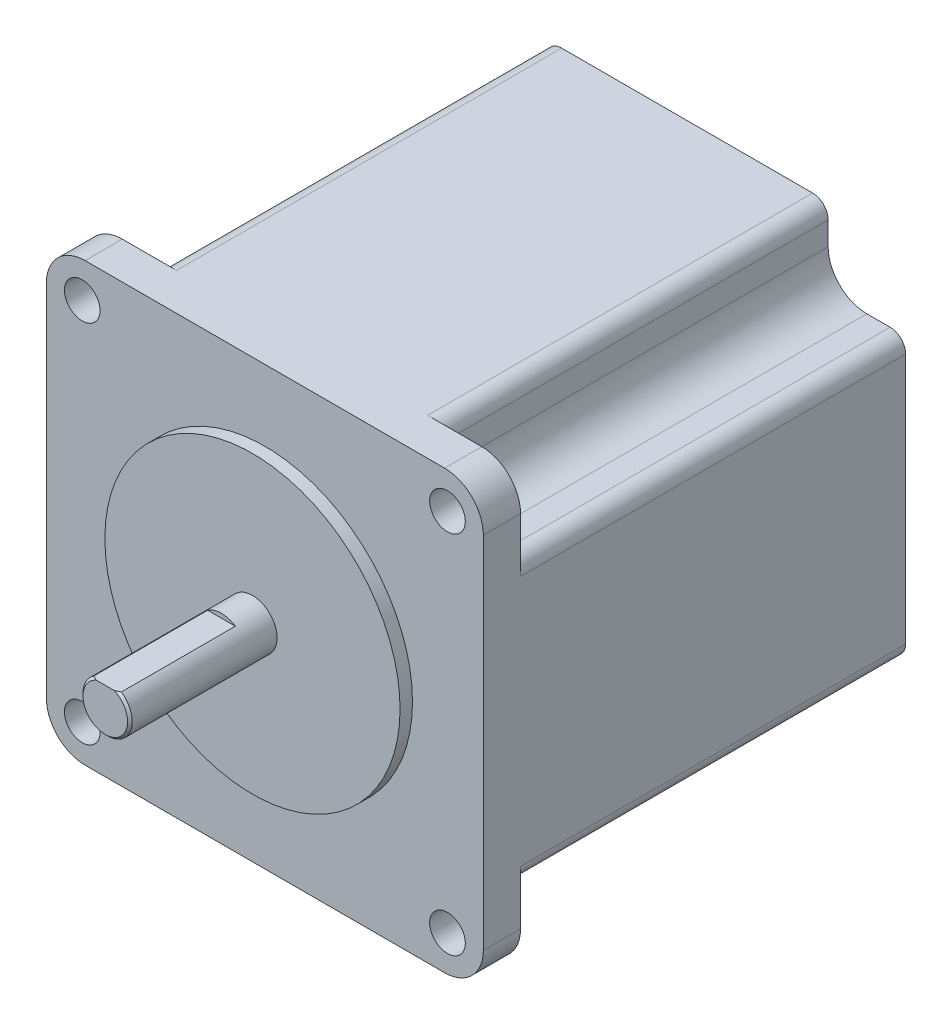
ISO-10303-21;
HEADER;
FILE_DESCRIPTION(('STEP AP214'),'2;1');
FILE_NAME('part.step','',(''),(''),'','','');
FILE_SCHEMA(('AUTOMOTIVE_DESIGN { 1 0 10303 214 1 1 1 1 }'));
ENDSEC;
DATA;
#1=APPLICATION_CONTEXT('core data for automotive mechanical design processes');
#2=APPLICATION_PROTOCOL_DEFINITION('international standard','automotive_design',2000,#1);
#3=PRODUCT_CONTEXT('',#1,'mechanical');
#4=PRODUCT('Part','Part','',(#3));
#5=PRODUCT_RELATED_PRODUCT_CATEGORY('part','',(#4));
#6=PRODUCT_DEFINITION_FORMATION('','',#4);
#7=PRODUCT_DEFINITION_CONTEXT('part definition',#1,'design');
#8=PRODUCT_DEFINITION('design','',#6,#7);
#9=PRODUCT_DEFINITION_SHAPE('','',#8);
#10=(LENGTH_UNIT() NAMED_UNIT(*) SI_UNIT(.MILLI.,.METRE.));
#11=(NAMED_UNIT(*) PLANE_ANGLE_UNIT() SI_UNIT($,.RADIAN.));
#12=(NAMED_UNIT(*) SI_UNIT($,.STERADIAN.) SOLID_ANGLE_UNIT());
#13=UNCERTAINTY_MEASURE_WITH_UNIT(LENGTH_MEASURE(1.E-05),#10,'distance_accuracy_value','');
#14=(GEOMETRIC_REPRESENTATION_CONTEXT(3) GLOBAL_UNCERTAINTY_ASSIGNED_CONTEXT((#13)) GLOBAL_UNIT_ASSIGNED_CONTEXT((#10,
#11,#12)) REPRESENTATION_CONTEXT('',''));
#15=CARTESIAN_POINT('',(0.,0.,0.));
#16=DIRECTION('',(0.,0.,1.));
#17=DIRECTION('',(1.,0.,0.));
#18=AXIS2_PLACEMENT_3D('',#15,#16,#17);
#19=CARTESIAN_POINT('',(23.2,-23.2,-56.1));
#20=DIRECTION('',(0.,0.,1.));
#21=DIRECTION('',(1.,0.,0.));
#22=AXIS2_PLACEMENT_3D('',#19,#20,#21);
#23=CYLINDRICAL_SURFACE('',#22,5.);
#24=CARTESIAN_POINT('',(23.2,-23.2,-6.4));
#25=DIRECTION('',(0.,0.,-1.));
#26=DIRECTION('',(-1.,0.,0.));
#27=AXIS2_PLACEMENT_3D('',#24,#25,#26);
#28=CIRCLE('',#27,5.);
#29=CARTESIAN_POINT('',(28.2,-23.2,-6.4));
#30=VERTEX_POINT('',#29);
#31=CARTESIAN_POINT('',(23.2,-28.2,-6.4));
#32=VERTEX_POINT('',#31);
#33=EDGE_CURVE('E309',#30,#32,#28,.T.);
#34=ORIENTED_EDGE('',*,*,#33,.F.);
#35=DIRECTION('',(0.,0.,1.));
#36=VECTOR('',#35,1.);
#37=CARTESIAN_POINT('',(28.2,-23.2,-56.1));
#38=LINE('',#37,#36);
#39=CARTESIAN_POINT('',(28.2,-23.2,-1.6));
#40=VERTEX_POINT('',#39);
#41=EDGE_CURVE('E474',#30,#40,#38,.T.);
#42=ORIENTED_EDGE('',*,*,#41,.T.);
#43=CARTESIAN_POINT('',(23.2,-23.2,-1.6));
#44=DIRECTION('',(0.,0.,-1.));
#45=DIRECTION('',(1.,0.,0.));
#46=AXIS2_PLACEMENT_3D('',#43,#44,#45);
#47=CIRCLE('',#46,5.);
#48=CARTESIAN_POINT('',(23.2,-28.2,-1.6));
#49=VERTEX_POINT('',#48);
#50=EDGE_CURVE('E464',#40,#49,#47,.T.);
#51=ORIENTED_EDGE('',*,*,#50,.T.);
#52=DIRECTION('',(0.,0.,1.));
#53=VECTOR('',#52,1.);
#54=CARTESIAN_POINT('',(23.2,-28.2,-56.1));
#55=LINE('',#54,#53);
#56=EDGE_CURVE('E510',#32,#49,#55,.T.);
#57=ORIENTED_EDGE('',*,*,#56,.F.);
#58=EDGE_LOOP('',(#34,#42,#51,#57));
#59=FACE_BOUND('',#58,.T.);
#60=ADVANCED_FACE('F35',(#59),#23,.T.);
#61=CARTESIAN_POINT('',(-23.2,-23.2,-56.1));
#62=DIRECTION('',(0.,0.,1.));
#63=DIRECTION('',(1.,0.,0.));
#64=AXIS2_PLACEMENT_3D('',#61,#62,#63);
#65=CYLINDRICAL_SURFACE('',#64,5.);
#66=CARTESIAN_POINT('',(-23.2,-23.2,-6.4));
#67=DIRECTION('',(0.,0.,-1.));
#68=DIRECTION('',(-1.,0.,0.));
#69=AXIS2_PLACEMENT_3D('',#66,#67,#68);
#70=CIRCLE('',#69,5.);
#71=CARTESIAN_POINT('',(-23.2,-28.2,-6.4));
#72=VERTEX_POINT('',#71);
#73=CARTESIAN_POINT('',(-28.2,-23.2,-6.4));
#74=VERTEX_POINT('',#73);
#75=EDGE_CURVE('E354',#72,#74,#70,.T.);
#76=ORIENTED_EDGE('',*,*,#75,.F.);
#77=DIRECTION('',(0.,0.,1.));
#78=VECTOR('',#77,1.);
#79=CARTESIAN_POINT('',(-23.2,-28.2,-56.1));
#80=LINE('',#79,#78);
#81=CARTESIAN_POINT('',(-23.2,-28.2,-1.6));
#82=VERTEX_POINT('',#81);
#83=EDGE_CURVE('E508',#72,#82,#80,.T.);
#84=ORIENTED_EDGE('',*,*,#83,.T.);
#85=CARTESIAN_POINT('',(-23.2,-23.2,-1.6));
#86=DIRECTION('',(0.,0.,-1.));
#87=DIRECTION('',(1.,0.,0.));
#88=AXIS2_PLACEMENT_3D('',#85,#86,#87);
#89=CIRCLE('',#88,5.);
#90=CARTESIAN_POINT('',(-28.2,-23.2,-1.6));
#91=VERTEX_POINT('',#90);
#92=EDGE_CURVE('E480',#82,#91,#89,.T.);
#93=ORIENTED_EDGE('',*,*,#92,.T.);
#94=DIRECTION('',(0.,0.,1.));
#95=VECTOR('',#94,1.);
#96=CARTESIAN_POINT('',(-28.2,-23.2,-56.1));
#97=LINE('',#96,#95);
#98=EDGE_CURVE('E506',#74,#91,#97,.T.);
#99=ORIENTED_EDGE('',*,*,#98,.F.);
#100=EDGE_LOOP('',(#76,#84,#93,#99));
#101=FACE_BOUND('',#100,.T.);
#102=ADVANCED_FACE('F595',(#101),#65,.T.);
#103=CARTESIAN_POINT('',(23.2,23.2,-56.1));
#104=DIRECTION('',(0.,0.,1.));
#105=DIRECTION('',(1.,0.,0.));
#106=AXIS2_PLACEMENT_3D('',#103,#104,#105);
#107=CYLINDRICAL_SURFACE('',#106,5.);
#108=CARTESIAN_POINT('',(23.2,23.2,-6.4));
#109=DIRECTION('',(0.,0.,-1.));
#110=DIRECTION('',(-1.,0.,0.));
#111=AXIS2_PLACEMENT_3D('',#108,#109,#110);
#112=CIRCLE('',#111,5.);
#113=CARTESIAN_POINT('',(23.2,28.2,-6.4));
#114=VERTEX_POINT('',#113);
#115=CARTESIAN_POINT('',(28.2,23.2,-6.4));
#116=VERTEX_POINT('',#115);
#117=EDGE_CURVE('E401',#114,#116,#112,.T.);
#118=ORIENTED_EDGE('',*,*,#117,.F.);
#119=DIRECTION('',(0.,0.,1.));
#120=VECTOR('',#119,1.);
#121=CARTESIAN_POINT('',(23.2,28.2,-56.1));
#122=LINE('',#121,#120);
#123=CARTESIAN_POINT('',(23.2,28.2,-1.6));
#124=VERTEX_POINT('',#123);
#125=EDGE_CURVE('E500',#114,#124,#122,.T.);
#126=ORIENTED_EDGE('',*,*,#125,.T.);
#127=CARTESIAN_POINT('',(23.2,23.2,-1.6));
#128=DIRECTION('',(0.,0.,-1.));
#129=DIRECTION('',(1.,0.,0.));
#130=AXIS2_PLACEMENT_3D('',#127,#128,#129);
#131=CIRCLE('',#130,5.);
#132=CARTESIAN_POINT('',(28.2,23.2,-1.6));
#133=VERTEX_POINT('',#132);
#134=EDGE_CURVE('E492',#124,#133,#131,.T.);
#135=ORIENTED_EDGE('',*,*,#134,.T.);
#136=DIRECTION('',(0.,0.,1.));
#137=VECTOR('',#136,1.);
#138=CARTESIAN_POINT('',(28.2,23.2,-56.1));
#139=LINE('',#138,#137);
#140=EDGE_CURVE('E498',#116,#133,#139,.T.);
#141=ORIENTED_EDGE('',*,*,#140,.F.);
#142=EDGE_LOOP('',(#118,#126,#135,#141));
#143=FACE_BOUND('',#142,.T.);
#144=ADVANCED_FACE('F586',(#143),#107,.T.);
#145=CARTESIAN_POINT('',(0.,0.,0.));
#146=DIRECTION('',(0.,0.,1.));
#147=DIRECTION('',(1.,0.,0.));
#148=AXIS2_PLACEMENT_3D('',#145,#146,#147);
#149=PLANE('',#148);
#150=CARTESIAN_POINT('',(0.,0.,0.));
#151=DIRECTION('',(0.,0.,1.));
#152=DIRECTION('',(1.,0.,0.));
#153=AXIS2_PLACEMENT_3D('',#150,#151,#152);
#154=CIRCLE('',#153,19.05);
#155=CARTESIAN_POINT('',(19.05,0.,0.));
#156=VERTEX_POINT('',#155);
#157=EDGE_CURVE('E525',#156,#156,#154,.T.);
#158=ORIENTED_EDGE('',*,*,#157,.T.);
#159=EDGE_LOOP('',(#158));
#160=FACE_BOUND('',#159,.T.);
#161=CARTESIAN_POINT('',(0.,0.,0.));
#162=DIRECTION('',(0.,0.,1.));
#163=DIRECTION('',(1.,0.,0.));
#164=AXIS2_PLACEMENT_3D('',#161,#162,#163);
#165=CIRCLE('',#164,3.175);
#166=CARTESIAN_POINT('',(3.175,0.,0.));
#167=VERTEX_POINT('',#166);
#168=EDGE_CURVE('E522',#167,#167,#165,.T.);
#169=ORIENTED_EDGE('',*,*,#168,.F.);
#170=EDGE_LOOP('',(#169));
#171=FACE_BOUND('',#170,.T.);
#172=ADVANCED_FACE('F584',(#160,#171),#149,.T.);
#173=CARTESIAN_POINT('',(0.,0.,-1.6));
#174=DIRECTION('',(0.,0.,1.));
#175=DIRECTION('',(1.,0.,0.));
#176=AXIS2_PLACEMENT_3D('',#173,#174,#175);
#177=CYLINDRICAL_SURFACE('',#176,19.05);
#178=CARTESIAN_POINT('',(0.,0.,-1.6));
#179=DIRECTION('',(0.,0.,1.));
#180=DIRECTION('',(1.,0.,0.));
#181=AXIS2_PLACEMENT_3D('',#178,#179,#180);
#182=CIRCLE('',#181,19.05);
#183=CARTESIAN_POINT('',(19.05,0.,-1.6));
#184=VERTEX_POINT('',#183);
#185=EDGE_CURVE('E512',#184,#184,#182,.F.);
#186=ORIENTED_EDGE('',*,*,#185,.F.);
#187=EDGE_LOOP('',(#186));
#188=FACE_BOUND('',#187,.T.);
#189=ORIENTED_EDGE('',*,*,#157,.F.);
#190=EDGE_LOOP('',(#189));
#191=FACE_BOUND('',#190,.T.);
#192=ADVANCED_FACE('F583',(#188,#191),#177,.T.);
#193=CARTESIAN_POINT('',(0.,0.,19.));
#194=DIRECTION('',(0.,0.,-1.));
#195=DIRECTION('',(-1.,0.,0.));
#196=AXIS2_PLACEMENT_3D('',#193,#194,#195);
#197=CYLINDRICAL_SURFACE('',#196,3.175);
#198=DIRECTION('',(0.,0.,-1.));
#199=VECTOR('',#198,1.);
#200=CARTESIAN_POINT('',(1.78605710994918,2.625,19.));
#201=LINE('',#200,#199);
#202=CARTESIAN_POINT('',(1.78605710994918,2.625,4.));
#203=VERTEX_POINT('',#202);
#204=CARTESIAN_POINT('',(1.78605710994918,2.625,18.7));
#205=VERTEX_POINT('',#204);
#206=EDGE_CURVE('E518',#203,#205,#201,.F.);
#207=ORIENTED_EDGE('',*,*,#206,.T.);
#208=CARTESIAN_POINT('',(0.,0.,18.7));
#209=DIRECTION('',(0.,0.,1.));
#210=DIRECTION('',(1.,0.,0.));
#211=AXIS2_PLACEMENT_3D('',#208,#209,#210);
#212=CIRCLE('',#211,3.175);
#213=CARTESIAN_POINT('',(-1.78605710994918,2.625,18.7));
#214=VERTEX_POINT('',#213);
#215=EDGE_CURVE('E11',#205,#214,#212,.F.);
#216=ORIENTED_EDGE('',*,*,#215,.T.);
#217=DIRECTION('',(0.,0.,-1.));
#218=VECTOR('',#217,1.);
#219=CARTESIAN_POINT('',(-1.78605710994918,2.625,19.));
#220=LINE('',#219,#218);
#221=CARTESIAN_POINT('',(-1.78605710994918,2.625,4.));
#222=VERTEX_POINT('',#221);
#223=EDGE_CURVE('E520',#214,#222,#220,.T.);
#224=ORIENTED_EDGE('',*,*,#223,.T.);
#225=CARTESIAN_POINT('',(0.,0.,4.));
#226=DIRECTION('',(0.,0.,1.));
#227=DIRECTION('',(1.,0.,0.));
#228=AXIS2_PLACEMENT_3D('',#225,#226,#227);
#229=CIRCLE('',#228,3.175);
#230=EDGE_CURVE('E530',#203,#222,#229,.T.);
#231=ORIENTED_EDGE('',*,*,#230,.F.);
#232=EDGE_LOOP('',(#207,#216,#224,#231));
#233=FACE_BOUND('',#232,.T.);
#234=ORIENTED_EDGE('',*,*,#168,.T.);
#235=EDGE_LOOP('',(#234));
#236=FACE_BOUND('',#235,.T.);
#237=ADVANCED_FACE('F579',(#233,#236),#197,.T.);
#238=CARTESIAN_POINT('',(0.,0.,19.));
#239=DIRECTION('',(0.,0.,1.));
#240=DIRECTION('',(1.,0.,0.));
#241=AXIS2_PLACEMENT_3D('',#238,#239,#240);
#242=PLANE('',#241);
#243=DIRECTION('',(1.,0.,0.));
#244=VECTOR('',#243,1.);
#245=CARTESIAN_POINT('',(0.,2.625,19.));
#246=LINE('',#245,#244);
#247=CARTESIAN_POINT('',(-1.17260393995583,2.625,19.));
#248=VERTEX_POINT('',#247);
#249=CARTESIAN_POINT('',(1.17260393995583,2.625,19.));
#250=VERTEX_POINT('',#249);
#251=EDGE_CURVE('E528',#248,#250,#246,.T.);
#252=ORIENTED_EDGE('',*,*,#251,.F.);
#253=CARTESIAN_POINT('',(0.,0.,19.));
#254=DIRECTION('',(0.,0.,1.));
#255=DIRECTION('',(1.,0.,0.));
#256=AXIS2_PLACEMENT_3D('',#253,#254,#255);
#257=CIRCLE('',#256,2.87499999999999);
#258=EDGE_CURVE('E542',#248,#250,#257,.T.);
#259=ORIENTED_EDGE('',*,*,#258,.T.);
#260=EDGE_LOOP('',(#252,#259));
#261=FACE_BOUND('',#260,.T.);
#262=ADVANCED_FACE('F575',(#261),#242,.T.);
#263=CARTESIAN_POINT('',(0.,0.,4.));
#264=DIRECTION('',(0.,0.,1.));
#265=DIRECTION('',(1.,0.,0.));
#266=AXIS2_PLACEMENT_3D('',#263,#264,#265);
#267=PLANE('',#266);
#268=ORIENTED_EDGE('',*,*,#230,.T.);
#269=DIRECTION('',(1.,0.,0.));
#270=VECTOR('',#269,1.);
#271=CARTESIAN_POINT('',(-4.59956773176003,2.625,4.));
#272=LINE('',#271,#270);
#273=EDGE_CURVE('E515',#222,#203,#272,.T.);
#274=ORIENTED_EDGE('',*,*,#273,.T.);
#275=EDGE_LOOP('',(#268,#274));
#276=FACE_BOUND('',#275,.T.);
#277=ADVANCED_FACE('F573',(#276),#267,.T.);
#278=CARTESIAN_POINT('',(0.,2.625,4.));
#279=DIRECTION('',(0.,-1.,0.));
#280=DIRECTION('',(0.,0.,-1.));
#281=AXIS2_PLACEMENT_3D('',#278,#279,#280);
#282=PLANE('',#281);
#283=ORIENTED_EDGE('',*,*,#251,.T.);
#284=CARTESIAN_POINT('',(1.17260393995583,2.625,19.));
#285=CARTESIAN_POINT('',(1.22536416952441,2.625,18.9784772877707));
#286=CARTESIAN_POINT('',(1.27769536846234,2.625,18.9559264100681));
#287=CARTESIAN_POINT('',(1.38148707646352,2.625,18.9090288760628));
#288=CARTESIAN_POINT('',(1.43294838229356,2.625,18.8846839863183));
#289=CARTESIAN_POINT('',(1.53508217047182,2.625,18.8344201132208));
#290=CARTESIAN_POINT('',(1.58575477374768,2.625,18.8085013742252));
#291=CARTESIAN_POINT('',(1.68641811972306,2.625,18.7552545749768));
#292=CARTESIAN_POINT('',(1.73640815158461,2.625,18.7279251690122));
#293=CARTESIAN_POINT('',(1.78605710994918,2.625,18.7));
#294=B_SPLINE_CURVE_WITH_KNOTS('',3,(#284,#285,#286,#287,#288,#289,#290,#291,#292,#293),
.UNSPECIFIED.,.F.,.F.,(4,2,2,2,4),(0.,0.170920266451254,0.341674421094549,0.512402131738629,
0.683295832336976),.UNSPECIFIED.);
#295=EDGE_CURVE('E44',#250,#205,#294,.T.);
#296=ORIENTED_EDGE('',*,*,#295,.T.);
#297=ORIENTED_EDGE('',*,*,#206,.F.);
#298=ORIENTED_EDGE('',*,*,#273,.F.);
#299=ORIENTED_EDGE('',*,*,#223,.F.);
#300=CARTESIAN_POINT('',(-1.78605710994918,2.625,18.7));
#301=CARTESIAN_POINT('',(-1.73640815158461,2.625,18.7279251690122));
#302=CARTESIAN_POINT('',(-1.68641811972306,2.625,18.7552545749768));
#303=CARTESIAN_POINT('',(-1.58575477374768,2.625,18.8085013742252));
#304=CARTESIAN_POINT('',(-1.53508217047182,2.625,18.8344201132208));
#305=CARTESIAN_POINT('',(-1.43294838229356,2.625,18.8846839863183));
#306=CARTESIAN_POINT('',(-1.38148707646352,2.625,18.9090288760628));
#307=CARTESIAN_POINT('',(-1.27769536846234,2.625,18.9559264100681));
#308=CARTESIAN_POINT('',(-1.22536416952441,2.625,18.9784772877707));
#309=CARTESIAN_POINT('',(-1.17260393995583,2.625,19.));
#310=B_SPLINE_CURVE_WITH_KNOTS('',3,(#300,#301,#302,#303,#304,#305,#306,#307,#308,#309),
.UNSPECIFIED.,.F.,.F.,(4,2,2,2,4),(0.,0.170893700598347,0.341621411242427,0.512375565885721,
0.683295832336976),.UNSPECIFIED.);
#311=EDGE_CURVE('E559',#214,#248,#310,.T.);
#312=ORIENTED_EDGE('',*,*,#311,.T.);
#313=EDGE_LOOP('',(#283,#296,#297,#298,#299,#312));
#314=FACE_BOUND('',#313,.T.);
#315=ADVANCED_FACE('F567',(#314),#282,.F.);
#316=CARTESIAN_POINT('',(-23.2,-28.2,-56.1));
#317=DIRECTION('',(0.,1.,0.));
#318=DIRECTION('',(-1.,0.,0.));
#319=AXIS2_PLACEMENT_3D('',#316,#317,#318);
#320=PLANE('',#319);
#321=DIRECTION('',(0.,0.,-1.));
#322=VECTOR('',#321,1.);
#323=CARTESIAN_POINT('',(-16.2,-28.2,-6.4));
#324=LINE('',#323,#322);
#325=CARTESIAN_POINT('',(-16.2,-28.2,-6.4));
#326=VERTEX_POINT('',#325);
#327=CARTESIAN_POINT('',(-16.2,-28.2,-56.1));
#328=VERTEX_POINT('',#327);
#329=EDGE_CURVE('E338',#326,#328,#324,.T.);
#330=ORIENTED_EDGE('',*,*,#329,.T.);
#331=DIRECTION('',(-1.,0.,0.));
#332=VECTOR('',#331,1.);
#333=CARTESIAN_POINT('',(-23.2,-28.2,-56.1));
#334=LINE('',#333,#332);
#335=CARTESIAN_POINT('',(16.2,-28.2,-56.1));
#336=VERTEX_POINT('',#335);
#337=EDGE_CURVE('E465',#336,#328,#334,.T.);
#338=ORIENTED_EDGE('',*,*,#337,.F.);
#339=DIRECTION('',(0.,0.,-1.));
#340=VECTOR('',#339,1.);
#341=CARTESIAN_POINT('',(16.2,-28.2,-6.4));
#342=LINE('',#341,#340);
#343=CARTESIAN_POINT('',(16.2,-28.2,-6.4));
#344=VERTEX_POINT('',#343);
#345=EDGE_CURVE('E312',#344,#336,#342,.T.);
#346=ORIENTED_EDGE('',*,*,#345,.F.);
#347=DIRECTION('',(-1.,0.,0.));
#348=VECTOR('',#347,1.);
#349=CARTESIAN_POINT('',(-23.2,-28.2,-6.4));
#350=LINE('',#349,#348);
#351=EDGE_CURVE('E319',#32,#344,#350,.T.);
#352=ORIENTED_EDGE('',*,*,#351,.F.);
#353=ORIENTED_EDGE('',*,*,#56,.T.);
#354=DIRECTION('',(-1.,0.,0.));
#355=VECTOR('',#354,1.);
#356=CARTESIAN_POINT('',(-23.2,-28.2,-1.6));
#357=LINE('',#356,#355);
#358=EDGE_CURVE('E477',#49,#82,#357,.T.);
#359=ORIENTED_EDGE('',*,*,#358,.T.);
#360=ORIENTED_EDGE('',*,*,#83,.F.);
#361=DIRECTION('',(-1.,0.,0.));
#362=VECTOR('',#361,1.);
#363=CARTESIAN_POINT('',(-23.2,-28.2,-6.4));
#364=LINE('',#363,#362);
#365=EDGE_CURVE('E366',#326,#72,#364,.T.);
#366=ORIENTED_EDGE('',*,*,#365,.F.);
#367=EDGE_LOOP('',(#330,#338,#346,#352,#353,#359,#360,#366));
#368=FACE_BOUND('',#367,.T.);
#369=ADVANCED_FACE('F572',(#368),#320,.F.);
#370=CARTESIAN_POINT('',(-28.2,23.2,-56.1));
#371=DIRECTION('',(1.,0.,0.));
#372=DIRECTION('',(0.,1.,0.));
#373=AXIS2_PLACEMENT_3D('',#370,#371,#372);
#374=PLANE('',#373);
#375=DIRECTION('',(0.,0.,-1.));
#376=VECTOR('',#375,1.);
#377=CARTESIAN_POINT('',(-28.2,16.2,-6.4));
#378=LINE('',#377,#376);
#379=CARTESIAN_POINT('',(-28.2,16.2,-6.4));
#380=VERTEX_POINT('',#379);
#381=CARTESIAN_POINT('',(-28.2,16.2,-56.1));
#382=VERTEX_POINT('',#381);
#383=EDGE_CURVE('E446',#380,#382,#378,.T.);
#384=ORIENTED_EDGE('',*,*,#383,.T.);
#385=DIRECTION('',(0.,1.,0.));
#386=VECTOR('',#385,1.);
#387=CARTESIAN_POINT('',(-28.2,23.2,-56.1));
#388=LINE('',#387,#386);
#389=CARTESIAN_POINT('',(-28.2,-16.2,-56.1));
#390=VERTEX_POINT('',#389);
#391=EDGE_CURVE('E467',#390,#382,#388,.T.);
#392=ORIENTED_EDGE('',*,*,#391,.F.);
#393=DIRECTION('',(0.,0.,-1.));
#394=VECTOR('',#393,1.);
#395=CARTESIAN_POINT('',(-28.2,-16.2,-6.4));
#396=LINE('',#395,#394);
#397=CARTESIAN_POINT('',(-28.2,-16.2,-6.4));
#398=VERTEX_POINT('',#397);
#399=EDGE_CURVE('E361',#398,#390,#396,.T.);
#400=ORIENTED_EDGE('',*,*,#399,.F.);
#401=DIRECTION('',(0.,1.,0.));
#402=VECTOR('',#401,1.);
#403=CARTESIAN_POINT('',(-28.2,23.2,-6.4));
#404=LINE('',#403,#402);
#405=EDGE_CURVE('E538',#74,#398,#404,.T.);
#406=ORIENTED_EDGE('',*,*,#405,.F.);
#407=ORIENTED_EDGE('',*,*,#98,.T.);
#408=DIRECTION('',(0.,1.,0.));
#409=VECTOR('',#408,1.);
#410=CARTESIAN_POINT('',(-28.2,23.2,-1.6));
#411=LINE('',#410,#409);
#412=CARTESIAN_POINT('',(-28.2,23.2,-1.6));
#413=VERTEX_POINT('',#412);
#414=EDGE_CURVE('E483',#91,#413,#411,.T.);
#415=ORIENTED_EDGE('',*,*,#414,.T.);
#416=DIRECTION('',(0.,0.,1.));
#417=VECTOR('',#416,1.);
#418=CARTESIAN_POINT('',(-28.2,23.2,-56.1));
#419=LINE('',#418,#417);
#420=CARTESIAN_POINT('',(-28.2,23.2,-6.4));
#421=VERTEX_POINT('',#420);
#422=EDGE_CURVE('E504',#421,#413,#419,.T.);
#423=ORIENTED_EDGE('',*,*,#422,.F.);
#424=DIRECTION('',(0.,-1.,0.));
#425=VECTOR('',#424,1.);
#426=CARTESIAN_POINT('',(-28.2,23.2,-6.4));
#427=LINE('',#426,#425);
#428=EDGE_CURVE('E461',#421,#380,#427,.T.);
#429=ORIENTED_EDGE('',*,*,#428,.T.);
#430=EDGE_LOOP('',(#384,#392,#400,#406,#407,#415,#423,#429));
#431=FACE_BOUND('',#430,.T.);
#432=ADVANCED_FACE('F605',(#431),#374,.F.);
#433=CARTESIAN_POINT('',(-23.2,23.2,-56.1));
#434=DIRECTION('',(0.,0.,1.));
#435=DIRECTION('',(1.,0.,0.));
#436=AXIS2_PLACEMENT_3D('',#433,#434,#435);
#437=CYLINDRICAL_SURFACE('',#436,5.);
#438=DIRECTION('',(0.,0.,1.));
#439=VECTOR('',#438,1.);
#440=CARTESIAN_POINT('',(-23.2,28.2,-56.1));
#441=LINE('',#440,#439);
#442=CARTESIAN_POINT('',(-23.2,28.2,-6.4));
#443=VERTEX_POINT('',#442);
#444=CARTESIAN_POINT('',(-23.2,28.2,-1.6));
#445=VERTEX_POINT('',#444);
#446=EDGE_CURVE('E502',#443,#445,#441,.T.);
#447=ORIENTED_EDGE('',*,*,#446,.F.);
#448=CARTESIAN_POINT('',(-23.2,23.2,-6.4));
#449=DIRECTION('',(0.,0.,1.));
#450=DIRECTION('',(1.,0.,0.));
#451=AXIS2_PLACEMENT_3D('',#448,#449,#450);
#452=CIRCLE('',#451,5.);
#453=EDGE_CURVE('E449',#443,#421,#452,.T.);
#454=ORIENTED_EDGE('',*,*,#453,.T.);
#455=ORIENTED_EDGE('',*,*,#422,.T.);
#456=CARTESIAN_POINT('',(-23.2,23.2,-1.6));
#457=DIRECTION('',(0.,0.,-1.));
#458=DIRECTION('',(1.,0.,0.));
#459=AXIS2_PLACEMENT_3D('',#456,#457,#458);
#460=CIRCLE('',#459,5.);
#461=EDGE_CURVE('E486',#413,#445,#460,.T.);
#462=ORIENTED_EDGE('',*,*,#461,.T.);
#463=EDGE_LOOP('',(#447,#454,#455,#462));
#464=FACE_BOUND('',#463,.T.);
#465=ADVANCED_FACE('F610',(#464),#437,.T.);
#466=CARTESIAN_POINT('',(23.2,28.2,-56.1));
#467=DIRECTION('',(0.,-1.,0.));
#468=DIRECTION('',(1.,0.,0.));
#469=AXIS2_PLACEMENT_3D('',#466,#467,#468);
#470=PLANE('',#469);
#471=DIRECTION('',(0.,0.,-1.));
#472=VECTOR('',#471,1.);
#473=CARTESIAN_POINT('',(16.2,28.2,-6.4));
#474=LINE('',#473,#472);
#475=CARTESIAN_POINT('',(16.2,28.2,-6.4));
#476=VERTEX_POINT('',#475);
#477=CARTESIAN_POINT('',(16.2,28.2,-56.1));
#478=VERTEX_POINT('',#477);
#479=EDGE_CURVE('E385',#476,#478,#474,.T.);
#480=ORIENTED_EDGE('',*,*,#479,.T.);
#481=DIRECTION('',(1.,0.,0.));
#482=VECTOR('',#481,1.);
#483=CARTESIAN_POINT('',(0.,28.2,-56.1));
#484=LINE('',#483,#482);
#485=CARTESIAN_POINT('',(-16.2,28.2,-56.1));
#486=VERTEX_POINT('',#485);
#487=EDGE_CURVE('E470',#486,#478,#484,.T.);
#488=ORIENTED_EDGE('',*,*,#487,.F.);
#489=DIRECTION('',(0.,0.,-1.));
#490=VECTOR('',#489,1.);
#491=CARTESIAN_POINT('',(-16.2,28.2,-6.4));
#492=LINE('',#491,#490);
#493=CARTESIAN_POINT('',(-16.2,28.2,-6.4));
#494=VERTEX_POINT('',#493);
#495=EDGE_CURVE('E432',#494,#486,#492,.T.);
#496=ORIENTED_EDGE('',*,*,#495,.F.);
#497=DIRECTION('',(-1.,0.,0.));
#498=VECTOR('',#497,1.);
#499=CARTESIAN_POINT('',(23.2,28.2,-6.4));
#500=LINE('',#499,#498);
#501=EDGE_CURVE('E533',#494,#443,#500,.T.);
#502=ORIENTED_EDGE('',*,*,#501,.T.);
#503=ORIENTED_EDGE('',*,*,#446,.T.);
#504=DIRECTION('',(1.,0.,0.));
#505=VECTOR('',#504,1.);
#506=CARTESIAN_POINT('',(23.2,28.2,-1.6));
#507=LINE('',#506,#505);
#508=EDGE_CURVE('E489',#445,#124,#507,.T.);
#509=ORIENTED_EDGE('',*,*,#508,.T.);
#510=ORIENTED_EDGE('',*,*,#125,.F.);
#511=DIRECTION('',(1.,0.,0.));
#512=VECTOR('',#511,1.);
#513=CARTESIAN_POINT('',(23.2,28.2,-6.4));
#514=LINE('',#513,#512);
#515=EDGE_CURVE('E413',#476,#114,#514,.T.);
#516=ORIENTED_EDGE('',*,*,#515,.F.);
#517=EDGE_LOOP('',(#480,#488,#496,#502,#503,#509,#510,#516));
#518=FACE_BOUND('',#517,.T.);
#519=ADVANCED_FACE('F614',(#518),#470,.F.);
#520=CARTESIAN_POINT('',(28.2,-23.2,-56.1));
#521=DIRECTION('',(-1.,0.,0.));
#522=DIRECTION('',(0.,0.,1.));
#523=AXIS2_PLACEMENT_3D('',#520,#521,#522);
#524=PLANE('',#523);
#525=DIRECTION('',(0.,0.,-1.));
#526=VECTOR('',#525,1.);
#527=CARTESIAN_POINT('',(28.2,-16.2,-6.4));
#528=LINE('',#527,#526);
#529=CARTESIAN_POINT('',(28.2,-16.2,-6.4));
#530=VERTEX_POINT('',#529);
#531=CARTESIAN_POINT('',(28.2,-16.2,-56.1));
#532=VERTEX_POINT('',#531);
#533=EDGE_CURVE('E314',#530,#532,#528,.T.);
#534=ORIENTED_EDGE('',*,*,#533,.T.);
#535=DIRECTION('',(0.,-1.,0.));
#536=VECTOR('',#535,1.);
#537=CARTESIAN_POINT('',(28.2,-23.2,-56.1));
#538=LINE('',#537,#536);
#539=CARTESIAN_POINT('',(28.2,16.2,-56.1));
#540=VERTEX_POINT('',#539);
#541=EDGE_CURVE('E472',#540,#532,#538,.T.);
#542=ORIENTED_EDGE('',*,*,#541,.F.);
#543=DIRECTION('',(0.,0.,-1.));
#544=VECTOR('',#543,1.);
#545=CARTESIAN_POINT('',(28.2,16.2,-6.4));
#546=LINE('',#545,#544);
#547=CARTESIAN_POINT('',(28.2,16.2,-6.4));
#548=VERTEX_POINT('',#547);
#549=EDGE_CURVE('E408',#548,#540,#546,.T.);
#550=ORIENTED_EDGE('',*,*,#549,.F.);
#551=DIRECTION('',(0.,-1.,0.));
#552=VECTOR('',#551,1.);
#553=CARTESIAN_POINT('',(28.2,-23.2,-6.4));
#554=LINE('',#553,#552);
#555=EDGE_CURVE('E536',#116,#548,#554,.T.);
#556=ORIENTED_EDGE('',*,*,#555,.F.);
#557=ORIENTED_EDGE('',*,*,#140,.T.);
#558=DIRECTION('',(0.,-1.,0.));
#559=VECTOR('',#558,1.);
#560=CARTESIAN_POINT('',(28.2,-23.2,-1.6));
#561=LINE('',#560,#559);
#562=EDGE_CURVE('E468',#133,#40,#561,.T.);
#563=ORIENTED_EDGE('',*,*,#562,.T.);
#564=ORIENTED_EDGE('',*,*,#41,.F.);
#565=DIRECTION('',(0.,-1.,0.));
#566=VECTOR('',#565,1.);
#567=CARTESIAN_POINT('',(28.2,-23.2,-6.4));
#568=LINE('',#567,#566);
#569=EDGE_CURVE('E540',#530,#30,#568,.T.);
#570=ORIENTED_EDGE('',*,*,#569,.F.);
#571=EDGE_LOOP('',(#534,#542,#550,#556,#557,#563,#564,#570));
#572=FACE_BOUND('',#571,.T.);
#573=ADVANCED_FACE('F618',(#572),#524,.F.);
#574=CARTESIAN_POINT('',(23.2,-23.2,-56.1));
#575=DIRECTION('',(0.,0.,1.));
#576=DIRECTION('',(1.,0.,0.));
#577=AXIS2_PLACEMENT_3D('',#574,#575,#576);
#578=PLANE('',#577);
#579=DIRECTION('',(0.,1.,0.));
#580=VECTOR('',#579,1.);
#581=CARTESIAN_POINT('',(18.2,-26.2,-56.1));
#582=LINE('',#581,#580);
#583=CARTESIAN_POINT('',(18.2,-26.2,-56.1));
#584=VERTEX_POINT('',#583);
#585=CARTESIAN_POINT('',(18.2,-23.2,-56.1));
#586=VERTEX_POINT('',#585);
#587=EDGE_CURVE('E285',#584,#586,#582,.T.);
#588=ORIENTED_EDGE('',*,*,#587,.F.);
#589=CARTESIAN_POINT('',(16.2,-26.2,-56.1));
#590=DIRECTION('',(0.,0.,1.));
#591=DIRECTION('',(1.,0.,0.));
#592=AXIS2_PLACEMENT_3D('',#589,#590,#591);
#593=CIRCLE('',#592,1.99999999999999);
#594=EDGE_CURVE('E288',#336,#584,#593,.T.);
#595=ORIENTED_EDGE('',*,*,#594,.F.);
#596=ORIENTED_EDGE('',*,*,#337,.T.);
#597=CARTESIAN_POINT('',(-16.2,-26.2,-56.1));
#598=DIRECTION('',(0.,0.,1.));
#599=DIRECTION('',(-1.,0.,0.));
#600=AXIS2_PLACEMENT_3D('',#597,#598,#599);
#601=CIRCLE('',#600,2.);
#602=CARTESIAN_POINT('',(-18.2,-26.2,-56.1));
#603=VERTEX_POINT('',#602);
#604=EDGE_CURVE('E321',#603,#328,#601,.T.);
#605=ORIENTED_EDGE('',*,*,#604,.F.);
#606=DIRECTION('',(0.,-1.,0.));
#607=VECTOR('',#606,1.);
#608=CARTESIAN_POINT('',(-18.2,-26.2,-56.1));
#609=LINE('',#608,#607);
#610=CARTESIAN_POINT('',(-18.2,-23.2,-56.1));
#611=VERTEX_POINT('',#610);
#612=EDGE_CURVE('E326',#611,#603,#609,.T.);
#613=ORIENTED_EDGE('',*,*,#612,.F.);
#614=CARTESIAN_POINT('',(-23.2,-23.2,-56.1));
#615=DIRECTION('',(0.,0.,-1.));
#616=DIRECTION('',(1.,0.,0.));
#617=AXIS2_PLACEMENT_3D('',#614,#615,#616);
#618=CIRCLE('',#617,5.);
#619=CARTESIAN_POINT('',(-23.2,-18.2,-56.1));
#620=VERTEX_POINT('',#619);
#621=EDGE_CURVE('E347',#620,#611,#618,.T.);
#622=ORIENTED_EDGE('',*,*,#621,.F.);
#623=DIRECTION('',(1.,0.,0.));
#624=VECTOR('',#623,1.);
#625=CARTESIAN_POINT('',(-23.2,-18.2,-56.1));
#626=LINE('',#625,#624);
#627=CARTESIAN_POINT('',(-26.2,-18.2,-56.1));
#628=VERTEX_POINT('',#627);
#629=EDGE_CURVE('E344',#628,#620,#626,.T.);
#630=ORIENTED_EDGE('',*,*,#629,.F.);
#631=CARTESIAN_POINT('',(-26.2,-16.2,-56.1));
#632=DIRECTION('',(0.,0.,1.));
#633=DIRECTION('',(-1.,0.,0.));
#634=AXIS2_PLACEMENT_3D('',#631,#632,#633);
#635=CIRCLE('',#634,2.);
#636=EDGE_CURVE('E341',#390,#628,#635,.T.);
#637=ORIENTED_EDGE('',*,*,#636,.F.);
#638=ORIENTED_EDGE('',*,*,#391,.T.);
#639=CARTESIAN_POINT('',(-26.2,16.2,-56.1));
#640=DIRECTION('',(0.,0.,1.));
#641=DIRECTION('',(1.,0.,0.));
#642=AXIS2_PLACEMENT_3D('',#639,#640,#641);
#643=CIRCLE('',#642,2.);
#644=CARTESIAN_POINT('',(-26.2,18.2,-56.1));
#645=VERTEX_POINT('',#644);
#646=EDGE_CURVE('E420',#645,#382,#643,.T.);
#647=ORIENTED_EDGE('',*,*,#646,.F.);
#648=DIRECTION('',(-1.,0.,0.));
#649=VECTOR('',#648,1.);
#650=CARTESIAN_POINT('',(-23.2,18.2,-56.1));
#651=LINE('',#650,#649);
#652=CARTESIAN_POINT('',(-23.2,18.2,-56.1));
#653=VERTEX_POINT('',#652);
#654=EDGE_CURVE('E441',#653,#645,#651,.T.);
#655=ORIENTED_EDGE('',*,*,#654,.F.);
#656=CARTESIAN_POINT('',(-23.2,23.2,-56.1));
#657=DIRECTION('',(0.,0.,-1.));
#658=DIRECTION('',(-1.,0.,0.));
#659=AXIS2_PLACEMENT_3D('',#656,#657,#658);
#660=CIRCLE('',#659,5.);
#661=CARTESIAN_POINT('',(-18.2,23.2,-56.1));
#662=VERTEX_POINT('',#661);
#663=EDGE_CURVE('E438',#662,#653,#660,.T.);
#664=ORIENTED_EDGE('',*,*,#663,.F.);
#665=DIRECTION('',(0.,-1.,0.));
#666=VECTOR('',#665,1.);
#667=CARTESIAN_POINT('',(-18.2,26.2,-56.1));
#668=LINE('',#667,#666);
#669=CARTESIAN_POINT('',(-18.2,26.2,-56.1));
#670=VERTEX_POINT('',#669);
#671=EDGE_CURVE('E435',#670,#662,#668,.T.);
#672=ORIENTED_EDGE('',*,*,#671,.F.);
#673=CARTESIAN_POINT('',(-16.2,26.2,-56.1));
#674=DIRECTION('',(0.,0.,1.));
#675=DIRECTION('',(1.,0.,0.));
#676=AXIS2_PLACEMENT_3D('',#673,#674,#675);
#677=CIRCLE('',#676,2.);
#678=EDGE_CURVE('E415',#486,#670,#677,.T.);
#679=ORIENTED_EDGE('',*,*,#678,.F.);
#680=ORIENTED_EDGE('',*,*,#487,.T.);
#681=CARTESIAN_POINT('',(16.2,26.2,-56.1));
#682=DIRECTION('',(0.,0.,1.));
#683=DIRECTION('',(-1.,0.,0.));
#684=AXIS2_PLACEMENT_3D('',#681,#682,#683);
#685=CIRCLE('',#684,1.99999999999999);
#686=CARTESIAN_POINT('',(18.2,26.2,-56.1));
#687=VERTEX_POINT('',#686);
#688=EDGE_CURVE('E368',#687,#478,#685,.T.);
#689=ORIENTED_EDGE('',*,*,#688,.F.);
#690=DIRECTION('',(0.,1.,0.));
#691=VECTOR('',#690,1.);
#692=CARTESIAN_POINT('',(18.2,26.2,-56.1));
#693=LINE('',#692,#691);
#694=CARTESIAN_POINT('',(18.2,23.2,-56.1));
#695=VERTEX_POINT('',#694);
#696=EDGE_CURVE('E373',#695,#687,#693,.T.);
#697=ORIENTED_EDGE('',*,*,#696,.F.);
#698=CARTESIAN_POINT('',(23.2,23.2,-56.1));
#699=DIRECTION('',(0.,0.,-1.));
#700=DIRECTION('',(1.,0.,0.));
#701=AXIS2_PLACEMENT_3D('',#698,#699,#700);
#702=CIRCLE('',#701,5.);
#703=CARTESIAN_POINT('',(23.2,18.2,-56.1));
#704=VERTEX_POINT('',#703);
#705=EDGE_CURVE('E394',#704,#695,#702,.T.);
#706=ORIENTED_EDGE('',*,*,#705,.F.);
#707=DIRECTION('',(-1.,0.,0.));
#708=VECTOR('',#707,1.);
#709=CARTESIAN_POINT('',(23.2,18.2,-56.1));
#710=LINE('',#709,#708);
#711=CARTESIAN_POINT('',(26.2,18.2,-56.1));
#712=VERTEX_POINT('',#711);
#713=EDGE_CURVE('E391',#712,#704,#710,.T.);
#714=ORIENTED_EDGE('',*,*,#713,.F.);
#715=CARTESIAN_POINT('',(26.2,16.2,-56.1));
#716=DIRECTION('',(0.,0.,1.));
#717=DIRECTION('',(-1.,0.,0.));
#718=AXIS2_PLACEMENT_3D('',#715,#716,#717);
#719=CIRCLE('',#718,2.);
#720=EDGE_CURVE('E388',#540,#712,#719,.T.);
#721=ORIENTED_EDGE('',*,*,#720,.F.);
#722=ORIENTED_EDGE('',*,*,#541,.T.);
#723=CARTESIAN_POINT('',(26.2,-16.2,-56.1));
#724=DIRECTION('',(0.,0.,1.));
#725=DIRECTION('',(1.,0.,0.));
#726=AXIS2_PLACEMENT_3D('',#723,#724,#725);
#727=CIRCLE('',#726,2.);
#728=CARTESIAN_POINT('',(26.2,-18.2,-56.1));
#729=VERTEX_POINT('',#728);
#730=EDGE_CURVE('E302',#729,#532,#727,.T.);
#731=ORIENTED_EDGE('',*,*,#730,.F.);
#732=DIRECTION('',(1.,0.,0.));
#733=VECTOR('',#732,1.);
#734=CARTESIAN_POINT('',(23.2,-18.2,-56.1));
#735=LINE('',#734,#733);
#736=CARTESIAN_POINT('',(23.2,-18.2,-56.1));
#737=VERTEX_POINT('',#736);
#738=EDGE_CURVE('E299',#737,#729,#735,.T.);
#739=ORIENTED_EDGE('',*,*,#738,.F.);
#740=CARTESIAN_POINT('',(23.2,-23.2,-56.1));
#741=DIRECTION('',(0.,0.,-1.));
#742=DIRECTION('',(-1.,0.,0.));
#743=AXIS2_PLACEMENT_3D('',#740,#741,#742);
#744=CIRCLE('',#743,5.);
#745=EDGE_CURVE('E267',#586,#737,#744,.T.);
#746=ORIENTED_EDGE('',*,*,#745,.F.);
#747=EDGE_LOOP('',(#588,#595,#596,#605,#613,#622,#630,#637,#638,#647,#655,#664,#672,#679,#680,
#689,#697,#706,#714,#721,#722,#731,#739,#746));
#748=FACE_BOUND('',#747,.T.);
#749=ADVANCED_FACE('F625',(#748),#578,.F.);
#750=CARTESIAN_POINT('',(23.2,-23.2,-1.6));
#751=DIRECTION('',(0.,0.,1.));
#752=DIRECTION('',(1.,0.,0.));
#753=AXIS2_PLACEMENT_3D('',#750,#751,#752);
#754=PLANE('',#753);
#755=CARTESIAN_POINT('',(-23.57,-23.57,-1.6));
#756=DIRECTION('',(0.,0.,1.));
#757=DIRECTION('',(1.,0.,0.));
#758=AXIS2_PLACEMENT_3D('',#755,#756,#757);
#759=CIRCLE('',#758,2.3);
#760=CARTESIAN_POINT('',(-21.27,-23.57,-1.6));
#761=VERTEX_POINT('',#760);
#762=EDGE_CURVE('E556',#761,#761,#759,.T.);
#763=ORIENTED_EDGE('',*,*,#762,.F.);
#764=EDGE_LOOP('',(#763));
#765=FACE_BOUND('',#764,.T.);
#766=CARTESIAN_POINT('',(23.57,-23.57,-1.6));
#767=DIRECTION('',(0.,0.,1.));
#768=DIRECTION('',(1.,0.,0.));
#769=AXIS2_PLACEMENT_3D('',#766,#767,#768);
#770=CIRCLE('',#769,2.3);
#771=CARTESIAN_POINT('',(25.87,-23.57,-1.6));
#772=VERTEX_POINT('',#771);
#773=EDGE_CURVE('E552',#772,#772,#770,.T.);
#774=ORIENTED_EDGE('',*,*,#773,.F.);
#775=EDGE_LOOP('',(#774));
#776=FACE_BOUND('',#775,.T.);
#777=CARTESIAN_POINT('',(23.57,23.57,-1.6));
#778=DIRECTION('',(0.,0.,1.));
#779=DIRECTION('',(1.,0.,0.));
#780=AXIS2_PLACEMENT_3D('',#777,#778,#779);
#781=CIRCLE('',#780,2.3);
#782=CARTESIAN_POINT('',(25.87,23.57,-1.6));
#783=VERTEX_POINT('',#782);
#784=EDGE_CURVE('E548',#783,#783,#781,.T.);
#785=ORIENTED_EDGE('',*,*,#784,.F.);
#786=EDGE_LOOP('',(#785));
#787=FACE_BOUND('',#786,.T.);
#788=CARTESIAN_POINT('',(-23.57,23.57,-1.6));
#789=DIRECTION('',(0.,0.,1.));
#790=DIRECTION('',(1.,0.,0.));
#791=AXIS2_PLACEMENT_3D('',#788,#789,#790);
#792=CIRCLE('',#791,2.3);
#793=CARTESIAN_POINT('',(-21.27,23.57,-1.6));
#794=VERTEX_POINT('',#793);
#795=EDGE_CURVE('E291',#794,#794,#792,.T.);
#796=ORIENTED_EDGE('',*,*,#795,.F.);
#797=EDGE_LOOP('',(#796));
#798=FACE_BOUND('',#797,.T.);
#799=ORIENTED_EDGE('',*,*,#185,.T.);
#800=EDGE_LOOP('',(#799));
#801=FACE_BOUND('',#800,.T.);
#802=ORIENTED_EDGE('',*,*,#50,.F.);
#803=ORIENTED_EDGE('',*,*,#562,.F.);
#804=ORIENTED_EDGE('',*,*,#134,.F.);
#805=ORIENTED_EDGE('',*,*,#508,.F.);
#806=ORIENTED_EDGE('',*,*,#461,.F.);
#807=ORIENTED_EDGE('',*,*,#414,.F.);
#808=ORIENTED_EDGE('',*,*,#92,.F.);
#809=ORIENTED_EDGE('',*,*,#358,.F.);
#810=EDGE_LOOP('',(#802,#803,#804,#805,#806,#807,#808,#809));
#811=FACE_BOUND('',#810,.T.);
#812=ADVANCED_FACE('F627',(#765,#776,#787,#798,#801,#811),#754,.T.);
#813=CARTESIAN_POINT('',(-16.2,26.2,-6.4));
#814=DIRECTION('',(0.,0.,1.));
#815=DIRECTION('',(1.,0.,0.));
#816=AXIS2_PLACEMENT_3D('',#813,#814,#815);
#817=PLANE('',#816);
#818=CARTESIAN_POINT('',(-23.57,23.57,-6.4));
#819=DIRECTION('',(0.,0.,1.));
#820=DIRECTION('',(1.,0.,0.));
#821=AXIS2_PLACEMENT_3D('',#818,#819,#820);
#822=CIRCLE('',#821,2.3);
#823=CARTESIAN_POINT('',(-21.27,23.57,-6.4));
#824=VERTEX_POINT('',#823);
#825=EDGE_CURVE('E300',#824,#824,#822,.T.);
#826=ORIENTED_EDGE('',*,*,#825,.T.);
#827=EDGE_LOOP('',(#826));
#828=FACE_BOUND('',#827,.T.);
#829=ORIENTED_EDGE('',*,*,#453,.F.);
#830=ORIENTED_EDGE('',*,*,#501,.F.);
#831=CARTESIAN_POINT('',(-16.2,26.2,-6.4));
#832=DIRECTION('',(0.,0.,1.));
#833=DIRECTION('',(1.,0.,0.));
#834=AXIS2_PLACEMENT_3D('',#831,#832,#833);
#835=CIRCLE('',#834,2.);
#836=CARTESIAN_POINT('',(-18.2,26.2,-6.4));
#837=VERTEX_POINT('',#836);
#838=EDGE_CURVE('E416',#494,#837,#835,.T.);
#839=ORIENTED_EDGE('',*,*,#838,.T.);
#840=DIRECTION('',(0.,-1.,0.));
#841=VECTOR('',#840,1.);
#842=CARTESIAN_POINT('',(-18.2,26.2,-6.4));
#843=LINE('',#842,#841);
#844=CARTESIAN_POINT('',(-18.2,23.2,-6.4));
#845=VERTEX_POINT('',#844);
#846=EDGE_CURVE('E419',#837,#845,#843,.T.);
#847=ORIENTED_EDGE('',*,*,#846,.T.);
#848=CARTESIAN_POINT('',(-23.2,23.2,-6.4));
#849=DIRECTION('',(0.,0.,-1.));
#850=DIRECTION('',(-1.,0.,0.));
#851=AXIS2_PLACEMENT_3D('',#848,#849,#850);
#852=CIRCLE('',#851,5.);
#853=CARTESIAN_POINT('',(-23.2,18.2,-6.4));
#854=VERTEX_POINT('',#853);
#855=EDGE_CURVE('E423',#845,#854,#852,.T.);
#856=ORIENTED_EDGE('',*,*,#855,.T.);
#857=DIRECTION('',(-1.,0.,0.));
#858=VECTOR('',#857,1.);
#859=CARTESIAN_POINT('',(-23.2,18.2,-6.4));
#860=LINE('',#859,#858);
#861=CARTESIAN_POINT('',(-26.2,18.2,-6.4));
#862=VERTEX_POINT('',#861);
#863=EDGE_CURVE('E426',#854,#862,#860,.T.);
#864=ORIENTED_EDGE('',*,*,#863,.T.);
#865=CARTESIAN_POINT('',(-26.2,16.2,-6.4));
#866=DIRECTION('',(0.,0.,1.));
#867=DIRECTION('',(1.,0.,0.));
#868=AXIS2_PLACEMENT_3D('',#865,#866,#867);
#869=CIRCLE('',#868,2.);
#870=EDGE_CURVE('E429',#862,#380,#869,.T.);
#871=ORIENTED_EDGE('',*,*,#870,.T.);
#872=ORIENTED_EDGE('',*,*,#428,.F.);
#873=EDGE_LOOP('',(#829,#830,#839,#847,#856,#864,#871,#872));
#874=FACE_BOUND('',#873,.T.);
#875=ADVANCED_FACE('F630',(#828,#874),#817,.F.);
#876=CARTESIAN_POINT('',(-26.2,16.2,-6.4));
#877=DIRECTION('',(0.,0.,-1.));
#878=DIRECTION('',(-1.,0.,0.));
#879=AXIS2_PLACEMENT_3D('',#876,#877,#878);
#880=CYLINDRICAL_SURFACE('',#879,2.);
#881=ORIENTED_EDGE('',*,*,#646,.T.);
#882=ORIENTED_EDGE('',*,*,#383,.F.);
#883=ORIENTED_EDGE('',*,*,#870,.F.);
#884=DIRECTION('',(0.,0.,-1.));
#885=VECTOR('',#884,1.);
#886=CARTESIAN_POINT('',(-26.2,18.2,-6.4));
#887=LINE('',#886,#885);
#888=EDGE_CURVE('E450',#862,#645,#887,.T.);
#889=ORIENTED_EDGE('',*,*,#888,.T.);
#890=EDGE_LOOP('',(#881,#882,#883,#889));
#891=FACE_BOUND('',#890,.T.);
#892=ADVANCED_FACE('F651',(#891),#880,.T.);
#893=CARTESIAN_POINT('',(-23.2,18.2,-6.4));
#894=DIRECTION('',(0.,-1.,0.));
#895=DIRECTION('',(0.,0.,-1.));
#896=AXIS2_PLACEMENT_3D('',#893,#894,#895);
#897=PLANE('',#896);
#898=ORIENTED_EDGE('',*,*,#654,.T.);
#899=ORIENTED_EDGE('',*,*,#888,.F.);
#900=ORIENTED_EDGE('',*,*,#863,.F.);
#901=DIRECTION('',(0.,0.,-1.));
#902=VECTOR('',#901,1.);
#903=CARTESIAN_POINT('',(-23.2,18.2,-6.4));
#904=LINE('',#903,#902);
#905=EDGE_CURVE('E452',#854,#653,#904,.T.);
#906=ORIENTED_EDGE('',*,*,#905,.T.);
#907=EDGE_LOOP('',(#898,#899,#900,#906));
#908=FACE_BOUND('',#907,.T.);
#909=ADVANCED_FACE('F647',(#908),#897,.F.);
#910=CARTESIAN_POINT('',(-23.2,23.2,-6.4));
#911=DIRECTION('',(0.,0.,-1.));
#912=DIRECTION('',(-1.,0.,0.));
#913=AXIS2_PLACEMENT_3D('',#910,#911,#912);
#914=CYLINDRICAL_SURFACE('',#913,5.);
#915=ORIENTED_EDGE('',*,*,#663,.T.);
#916=ORIENTED_EDGE('',*,*,#905,.F.);
#917=ORIENTED_EDGE('',*,*,#855,.F.);
#918=DIRECTION('',(0.,0.,-1.));
#919=VECTOR('',#918,1.);
#920=CARTESIAN_POINT('',(-18.2,23.2,-6.4));
#921=LINE('',#920,#919);
#922=EDGE_CURVE('E454',#845,#662,#921,.T.);
#923=ORIENTED_EDGE('',*,*,#922,.T.);
#924=EDGE_LOOP('',(#915,#916,#917,#923));
#925=FACE_BOUND('',#924,.T.);
#926=ADVANCED_FACE('F643',(#925),#914,.F.);
#927=CARTESIAN_POINT('',(-18.2,26.2,-6.4));
#928=DIRECTION('',(1.,0.,0.));
#929=DIRECTION('',(0.,0.,-1.));
#930=AXIS2_PLACEMENT_3D('',#927,#928,#929);
#931=PLANE('',#930);
#932=ORIENTED_EDGE('',*,*,#671,.T.);
#933=ORIENTED_EDGE('',*,*,#922,.F.);
#934=ORIENTED_EDGE('',*,*,#846,.F.);
#935=DIRECTION('',(0.,0.,-1.));
#936=VECTOR('',#935,1.);
#937=CARTESIAN_POINT('',(-18.2,26.2,-6.4));
#938=LINE('',#937,#936);
#939=EDGE_CURVE('E456',#837,#670,#938,.T.);
#940=ORIENTED_EDGE('',*,*,#939,.T.);
#941=EDGE_LOOP('',(#932,#933,#934,#940));
#942=FACE_BOUND('',#941,.T.);
#943=ADVANCED_FACE('F639',(#942),#931,.F.);
#944=CARTESIAN_POINT('',(-16.2,26.2,-6.4));
#945=DIRECTION('',(0.,0.,-1.));
#946=DIRECTION('',(-1.,0.,0.));
#947=AXIS2_PLACEMENT_3D('',#944,#945,#946);
#948=CYLINDRICAL_SURFACE('',#947,2.);
#949=ORIENTED_EDGE('',*,*,#678,.T.);
#950=ORIENTED_EDGE('',*,*,#939,.F.);
#951=ORIENTED_EDGE('',*,*,#838,.F.);
#952=ORIENTED_EDGE('',*,*,#495,.T.);
#953=EDGE_LOOP('',(#949,#950,#951,#952));
#954=FACE_BOUND('',#953,.T.);
#955=ADVANCED_FACE('F635',(#954),#948,.T.);
#956=CARTESIAN_POINT('',(16.2,26.2,-6.4));
#957=DIRECTION('',(0.,0.,-1.));
#958=DIRECTION('',(-1.,0.,0.));
#959=AXIS2_PLACEMENT_3D('',#956,#957,#958);
#960=PLANE('',#959);
#961=CARTESIAN_POINT('',(23.57,23.57,-6.4));
#962=DIRECTION('',(0.,0.,-1.));
#963=DIRECTION('',(-1.,0.,0.));
#964=AXIS2_PLACEMENT_3D('',#961,#962,#963);
#965=CIRCLE('',#964,2.3);
#966=CARTESIAN_POINT('',(21.27,23.57,-6.4));
#967=VERTEX_POINT('',#966);
#968=EDGE_CURVE('E545',#967,#967,#965,.T.);
#969=ORIENTED_EDGE('',*,*,#968,.F.);
#970=EDGE_LOOP('',(#969));
#971=FACE_BOUND('',#970,.T.);
#972=ORIENTED_EDGE('',*,*,#515,.T.);
#973=ORIENTED_EDGE('',*,*,#117,.T.);
#974=ORIENTED_EDGE('',*,*,#555,.T.);
#975=CARTESIAN_POINT('',(26.2,16.2,-6.4));
#976=DIRECTION('',(0.,0.,1.));
#977=DIRECTION('',(-1.,0.,0.));
#978=AXIS2_PLACEMENT_3D('',#975,#976,#977);
#979=CIRCLE('',#978,2.);
#980=CARTESIAN_POINT('',(26.2,18.2,-6.4));
#981=VERTEX_POINT('',#980);
#982=EDGE_CURVE('E372',#548,#981,#979,.T.);
#983=ORIENTED_EDGE('',*,*,#982,.T.);
#984=DIRECTION('',(-1.,0.,0.));
#985=VECTOR('',#984,1.);
#986=CARTESIAN_POINT('',(23.2,18.2,-6.4));
#987=LINE('',#986,#985);
#988=CARTESIAN_POINT('',(23.2,18.2,-6.4));
#989=VERTEX_POINT('',#988);
#990=EDGE_CURVE('E376',#981,#989,#987,.T.);
#991=ORIENTED_EDGE('',*,*,#990,.T.);
#992=CARTESIAN_POINT('',(23.2,23.2,-6.4));
#993=DIRECTION('',(0.,0.,-1.));
#994=DIRECTION('',(1.,0.,0.));
#995=AXIS2_PLACEMENT_3D('',#992,#993,#994);
#996=CIRCLE('',#995,5.);
#997=CARTESIAN_POINT('',(18.2,23.2,-6.4));
#998=VERTEX_POINT('',#997);
#999=EDGE_CURVE('E379',#989,#998,#996,.T.);
#1000=ORIENTED_EDGE('',*,*,#999,.T.);
#1001=DIRECTION('',(0.,1.,0.));
#1002=VECTOR('',#1001,1.);
#1003=CARTESIAN_POINT('',(18.2,26.2,-6.4));
#1004=LINE('',#1003,#1002);
#1005=CARTESIAN_POINT('',(18.2,26.2,-6.4));
#1006=VERTEX_POINT('',#1005);
#1007=EDGE_CURVE('E382',#998,#1006,#1004,.T.);
#1008=ORIENTED_EDGE('',*,*,#1007,.T.);
#1009=CARTESIAN_POINT('',(16.2,26.2,-6.4));
#1010=DIRECTION('',(0.,0.,1.));
#1011=DIRECTION('',(-1.,0.,0.));
#1012=AXIS2_PLACEMENT_3D('',#1009,#1010,#1011);
#1013=CIRCLE('',#1012,1.99999999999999);
#1014=EDGE_CURVE('E369',#1006,#476,#1013,.T.);
#1015=ORIENTED_EDGE('',*,*,#1014,.T.);
#1016=EDGE_LOOP('',(#972,#973,#974,#983,#991,#1000,#1008,#1015));
#1017=FACE_BOUND('',#1016,.T.);
#1018=ADVANCED_FACE('F638',(#971,#1017),#960,.T.);
#1019=CARTESIAN_POINT('',(16.2,26.2,-6.4));
#1020=DIRECTION('',(0.,0.,-1.));
#1021=DIRECTION('',(-1.,0.,0.));
#1022=AXIS2_PLACEMENT_3D('',#1019,#1020,#1021);
#1023=CYLINDRICAL_SURFACE('',#1022,1.99999999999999);
#1024=ORIENTED_EDGE('',*,*,#688,.T.);
#1025=ORIENTED_EDGE('',*,*,#479,.F.);
#1026=ORIENTED_EDGE('',*,*,#1014,.F.);
#1027=DIRECTION('',(0.,0.,-1.));
#1028=VECTOR('',#1027,1.);
#1029=CARTESIAN_POINT('',(18.2,26.2,-6.4));
#1030=LINE('',#1029,#1028);
#1031=EDGE_CURVE('E399',#1006,#687,#1030,.T.);
#1032=ORIENTED_EDGE('',*,*,#1031,.T.);
#1033=EDGE_LOOP('',(#1024,#1025,#1026,#1032));
#1034=FACE_BOUND('',#1033,.T.);
#1035=ADVANCED_FACE('F659',(#1034),#1023,.T.);
#1036=CARTESIAN_POINT('',(18.2,26.2,-6.4));
#1037=DIRECTION('',(-1.,0.,0.));
#1038=DIRECTION('',(0.,0.,1.));
#1039=AXIS2_PLACEMENT_3D('',#1036,#1037,#1038);
#1040=PLANE('',#1039);
#1041=ORIENTED_EDGE('',*,*,#696,.T.);
#1042=ORIENTED_EDGE('',*,*,#1031,.F.);
#1043=ORIENTED_EDGE('',*,*,#1007,.F.);
#1044=DIRECTION('',(0.,0.,-1.));
#1045=VECTOR('',#1044,1.);
#1046=CARTESIAN_POINT('',(18.2,23.2,-6.4));
#1047=LINE('',#1046,#1045);
#1048=EDGE_CURVE('E402',#998,#695,#1047,.T.);
#1049=ORIENTED_EDGE('',*,*,#1048,.T.);
#1050=EDGE_LOOP('',(#1041,#1042,#1043,#1049));
#1051=FACE_BOUND('',#1050,.T.);
#1052=ADVANCED_FACE('F662',(#1051),#1040,.F.);
#1053=CARTESIAN_POINT('',(23.2,23.2,-6.4));
#1054=DIRECTION('',(0.,0.,-1.));
#1055=DIRECTION('',(-1.,0.,0.));
#1056=AXIS2_PLACEMENT_3D('',#1053,#1054,#1055);
#1057=CYLINDRICAL_SURFACE('',#1056,5.);
#1058=ORIENTED_EDGE('',*,*,#705,.T.);
#1059=ORIENTED_EDGE('',*,*,#1048,.F.);
#1060=ORIENTED_EDGE('',*,*,#999,.F.);
#1061=DIRECTION('',(0.,0.,-1.));
#1062=VECTOR('',#1061,1.);
#1063=CARTESIAN_POINT('',(23.2,18.2,-6.4));
#1064=LINE('',#1063,#1062);
#1065=EDGE_CURVE('E404',#989,#704,#1064,.T.);
#1066=ORIENTED_EDGE('',*,*,#1065,.T.);
#1067=EDGE_LOOP('',(#1058,#1059,#1060,#1066));
#1068=FACE_BOUND('',#1067,.T.);
#1069=ADVANCED_FACE('F672',(#1068),#1057,.F.);
#1070=CARTESIAN_POINT('',(23.2,18.2,-6.4));
#1071=DIRECTION('',(0.,-1.,0.));
#1072=DIRECTION('',(0.,0.,-1.));
#1073=AXIS2_PLACEMENT_3D('',#1070,#1071,#1072);
#1074=PLANE('',#1073);
#1075=ORIENTED_EDGE('',*,*,#713,.T.);
#1076=ORIENTED_EDGE('',*,*,#1065,.F.);
#1077=ORIENTED_EDGE('',*,*,#990,.F.);
#1078=DIRECTION('',(0.,0.,-1.));
#1079=VECTOR('',#1078,1.);
#1080=CARTESIAN_POINT('',(26.2,18.2,-6.4));
#1081=LINE('',#1080,#1079);
#1082=EDGE_CURVE('E406',#981,#712,#1081,.T.);
#1083=ORIENTED_EDGE('',*,*,#1082,.T.);
#1084=EDGE_LOOP('',(#1075,#1076,#1077,#1083));
#1085=FACE_BOUND('',#1084,.T.);
#1086=ADVANCED_FACE('F668',(#1085),#1074,.F.);
#1087=CARTESIAN_POINT('',(26.2,16.2,-6.4));
#1088=DIRECTION('',(0.,0.,-1.));
#1089=DIRECTION('',(-1.,0.,0.));
#1090=AXIS2_PLACEMENT_3D('',#1087,#1088,#1089);
#1091=CYLINDRICAL_SURFACE('',#1090,2.);
#1092=ORIENTED_EDGE('',*,*,#720,.T.);
#1093=ORIENTED_EDGE('',*,*,#1082,.F.);
#1094=ORIENTED_EDGE('',*,*,#982,.F.);
#1095=ORIENTED_EDGE('',*,*,#549,.T.);
#1096=EDGE_LOOP('',(#1092,#1093,#1094,#1095));
#1097=FACE_BOUND('',#1096,.T.);
#1098=ADVANCED_FACE('F664',(#1097),#1091,.T.);
#1099=CARTESIAN_POINT('',(-16.2,-26.2,-6.4));
#1100=DIRECTION('',(0.,0.,-1.));
#1101=DIRECTION('',(-1.,0.,0.));
#1102=AXIS2_PLACEMENT_3D('',#1099,#1100,#1101);
#1103=PLANE('',#1102);
#1104=CARTESIAN_POINT('',(-23.57,-23.57,-6.4));
#1105=DIRECTION('',(0.,0.,-1.));
#1106=DIRECTION('',(-1.,0.,0.));
#1107=AXIS2_PLACEMENT_3D('',#1104,#1105,#1106);
#1108=CIRCLE('',#1107,2.3);
#1109=CARTESIAN_POINT('',(-25.87,-23.57,-6.4));
#1110=VERTEX_POINT('',#1109);
#1111=EDGE_CURVE('E553',#1110,#1110,#1108,.T.);
#1112=ORIENTED_EDGE('',*,*,#1111,.F.);
#1113=EDGE_LOOP('',(#1112));
#1114=FACE_BOUND('',#1113,.T.);
#1115=ORIENTED_EDGE('',*,*,#365,.T.);
#1116=ORIENTED_EDGE('',*,*,#75,.T.);
#1117=ORIENTED_EDGE('',*,*,#405,.T.);
#1118=CARTESIAN_POINT('',(-26.2,-16.2,-6.4));
#1119=DIRECTION('',(0.,0.,1.));
#1120=DIRECTION('',(-1.,0.,0.));
#1121=AXIS2_PLACEMENT_3D('',#1118,#1119,#1120);
#1122=CIRCLE('',#1121,2.);
#1123=CARTESIAN_POINT('',(-26.2,-18.2,-6.4));
#1124=VERTEX_POINT('',#1123);
#1125=EDGE_CURVE('E325',#398,#1124,#1122,.T.);
#1126=ORIENTED_EDGE('',*,*,#1125,.T.);
#1127=DIRECTION('',(1.,0.,0.));
#1128=VECTOR('',#1127,1.);
#1129=CARTESIAN_POINT('',(-23.2,-18.2,-6.4));
#1130=LINE('',#1129,#1128);
#1131=CARTESIAN_POINT('',(-23.2,-18.2,-6.4));
#1132=VERTEX_POINT('',#1131);
#1133=EDGE_CURVE('E329',#1124,#1132,#1130,.T.);
#1134=ORIENTED_EDGE('',*,*,#1133,.T.);
#1135=CARTESIAN_POINT('',(-23.2,-23.2,-6.4));
#1136=DIRECTION('',(0.,0.,-1.));
#1137=DIRECTION('',(1.,0.,0.));
#1138=AXIS2_PLACEMENT_3D('',#1135,#1136,#1137);
#1139=CIRCLE('',#1138,5.);
#1140=CARTESIAN_POINT('',(-18.2,-23.2,-6.4));
#1141=VERTEX_POINT('',#1140);
#1142=EDGE_CURVE('E332',#1132,#1141,#1139,.T.);
#1143=ORIENTED_EDGE('',*,*,#1142,.T.);
#1144=DIRECTION('',(0.,-1.,0.));
#1145=VECTOR('',#1144,1.);
#1146=CARTESIAN_POINT('',(-18.2,-26.2,-6.4));
#1147=LINE('',#1146,#1145);
#1148=CARTESIAN_POINT('',(-18.2,-26.2,-6.4));
#1149=VERTEX_POINT('',#1148);
#1150=EDGE_CURVE('E335',#1141,#1149,#1147,.T.);
#1151=ORIENTED_EDGE('',*,*,#1150,.T.);
#1152=CARTESIAN_POINT('',(-16.2,-26.2,-6.4));
#1153=DIRECTION('',(0.,0.,1.));
#1154=DIRECTION('',(-1.,0.,0.));
#1155=AXIS2_PLACEMENT_3D('',#1152,#1153,#1154);
#1156=CIRCLE('',#1155,2.);
#1157=EDGE_CURVE('E322',#1149,#326,#1156,.T.);
#1158=ORIENTED_EDGE('',*,*,#1157,.T.);
#1159=EDGE_LOOP('',(#1115,#1116,#1117,#1126,#1134,#1143,#1151,#1158));
#1160=FACE_BOUND('',#1159,.T.);
#1161=ADVANCED_FACE('F667',(#1114,#1160),#1103,.T.);
#1162=CARTESIAN_POINT('',(-16.2,-26.2,-6.4));
#1163=DIRECTION('',(0.,0.,-1.));
#1164=DIRECTION('',(-1.,0.,0.));
#1165=AXIS2_PLACEMENT_3D('',#1162,#1163,#1164);
#1166=CYLINDRICAL_SURFACE('',#1165,2.);
#1167=ORIENTED_EDGE('',*,*,#604,.T.);
#1168=ORIENTED_EDGE('',*,*,#329,.F.);
#1169=ORIENTED_EDGE('',*,*,#1157,.F.);
#1170=DIRECTION('',(0.,0.,-1.));
#1171=VECTOR('',#1170,1.);
#1172=CARTESIAN_POINT('',(-18.2,-26.2,-6.4));
#1173=LINE('',#1172,#1171);
#1174=EDGE_CURVE('E352',#1149,#603,#1173,.T.);
#1175=ORIENTED_EDGE('',*,*,#1174,.T.);
#1176=EDGE_LOOP('',(#1167,#1168,#1169,#1175));
#1177=FACE_BOUND('',#1176,.T.);
#1178=ADVANCED_FACE('F683',(#1177),#1166,.T.);
#1179=CARTESIAN_POINT('',(-18.2,-26.2,-6.4));
#1180=DIRECTION('',(1.,0.,0.));
#1181=DIRECTION('',(0.,0.,-1.));
#1182=AXIS2_PLACEMENT_3D('',#1179,#1180,#1181);
#1183=PLANE('',#1182);
#1184=ORIENTED_EDGE('',*,*,#612,.T.);
#1185=ORIENTED_EDGE('',*,*,#1174,.F.);
#1186=ORIENTED_EDGE('',*,*,#1150,.F.);
#1187=DIRECTION('',(0.,0.,-1.));
#1188=VECTOR('',#1187,1.);
#1189=CARTESIAN_POINT('',(-18.2,-23.2,-6.4));
#1190=LINE('',#1189,#1188);
#1191=EDGE_CURVE('E355',#1141,#611,#1190,.T.);
#1192=ORIENTED_EDGE('',*,*,#1191,.T.);
#1193=EDGE_LOOP('',(#1184,#1185,#1186,#1192));
#1194=FACE_BOUND('',#1193,.T.);
#1195=ADVANCED_FACE('F686',(#1194),#1183,.F.);
#1196=CARTESIAN_POINT('',(-23.2,-23.2,-6.4));
#1197=DIRECTION('',(0.,0.,-1.));
#1198=DIRECTION('',(-1.,0.,0.));
#1199=AXIS2_PLACEMENT_3D('',#1196,#1197,#1198);
#1200=CYLINDRICAL_SURFACE('',#1199,5.);
#1201=ORIENTED_EDGE('',*,*,#621,.T.);
#1202=ORIENTED_EDGE('',*,*,#1191,.F.);
#1203=ORIENTED_EDGE('',*,*,#1142,.F.);
#1204=DIRECTION('',(0.,0.,-1.));
#1205=VECTOR('',#1204,1.);
#1206=CARTESIAN_POINT('',(-23.2,-18.2,-6.4));
#1207=LINE('',#1206,#1205);
#1208=EDGE_CURVE('E357',#1132,#620,#1207,.T.);
#1209=ORIENTED_EDGE('',*,*,#1208,.T.);
#1210=EDGE_LOOP('',(#1201,#1202,#1203,#1209));
#1211=FACE_BOUND('',#1210,.T.);
#1212=ADVANCED_FACE('F695',(#1211),#1200,.F.);
#1213=CARTESIAN_POINT('',(-23.2,-18.2,-6.4));
#1214=DIRECTION('',(0.,1.,0.));
#1215=DIRECTION('',(0.,0.,1.));
#1216=AXIS2_PLACEMENT_3D('',#1213,#1214,#1215);
#1217=PLANE('',#1216);
#1218=ORIENTED_EDGE('',*,*,#629,.T.);
#1219=ORIENTED_EDGE('',*,*,#1208,.F.);
#1220=ORIENTED_EDGE('',*,*,#1133,.F.);
#1221=DIRECTION('',(0.,0.,-1.));
#1222=VECTOR('',#1221,1.);
#1223=CARTESIAN_POINT('',(-26.2,-18.2,-6.4));
#1224=LINE('',#1223,#1222);
#1225=EDGE_CURVE('E359',#1124,#628,#1224,.T.);
#1226=ORIENTED_EDGE('',*,*,#1225,.T.);
#1227=EDGE_LOOP('',(#1218,#1219,#1220,#1226));
#1228=FACE_BOUND('',#1227,.T.);
#1229=ADVANCED_FACE('F691',(#1228),#1217,.F.);
#1230=CARTESIAN_POINT('',(-26.2,-16.2,-6.4));
#1231=DIRECTION('',(0.,0.,-1.));
#1232=DIRECTION('',(-1.,0.,0.));
#1233=AXIS2_PLACEMENT_3D('',#1230,#1231,#1232);
#1234=CYLINDRICAL_SURFACE('',#1233,2.);
#1235=ORIENTED_EDGE('',*,*,#636,.T.);
#1236=ORIENTED_EDGE('',*,*,#1225,.F.);
#1237=ORIENTED_EDGE('',*,*,#1125,.F.);
#1238=ORIENTED_EDGE('',*,*,#399,.T.);
#1239=EDGE_LOOP('',(#1235,#1236,#1237,#1238));
#1240=FACE_BOUND('',#1239,.T.);
#1241=ADVANCED_FACE('F688',(#1240),#1234,.T.);
#1242=CARTESIAN_POINT('',(23.2,-23.2,-6.4));
#1243=DIRECTION('',(0.,0.,-1.));
#1244=DIRECTION('',(-1.,0.,0.));
#1245=AXIS2_PLACEMENT_3D('',#1242,#1243,#1244);
#1246=PLANE('',#1245);
#1247=CARTESIAN_POINT('',(23.57,-23.57,-6.4));
#1248=DIRECTION('',(0.,0.,-1.));
#1249=DIRECTION('',(-1.,0.,0.));
#1250=AXIS2_PLACEMENT_3D('',#1247,#1248,#1249);
#1251=CIRCLE('',#1250,2.3);
#1252=CARTESIAN_POINT('',(21.27,-23.57,-6.4));
#1253=VERTEX_POINT('',#1252);
#1254=EDGE_CURVE('E549',#1253,#1253,#1251,.T.);
#1255=ORIENTED_EDGE('',*,*,#1254,.F.);
#1256=EDGE_LOOP('',(#1255));
#1257=FACE_BOUND('',#1256,.T.);
#1258=ORIENTED_EDGE('',*,*,#351,.T.);
#1259=CARTESIAN_POINT('',(16.2,-26.2,-6.4));
#1260=DIRECTION('',(0.,0.,1.));
#1261=DIRECTION('',(1.,0.,0.));
#1262=AXIS2_PLACEMENT_3D('',#1259,#1260,#1261);
#1263=CIRCLE('',#1262,1.99999999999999);
#1264=CARTESIAN_POINT('',(18.2,-26.2,-6.4));
#1265=VERTEX_POINT('',#1264);
#1266=EDGE_CURVE('E295',#344,#1265,#1263,.T.);
#1267=ORIENTED_EDGE('',*,*,#1266,.T.);
#1268=DIRECTION('',(0.,1.,0.));
#1269=VECTOR('',#1268,1.);
#1270=CARTESIAN_POINT('',(18.2,-26.2,-6.4));
#1271=LINE('',#1270,#1269);
#1272=CARTESIAN_POINT('',(18.2,-23.2,-6.4));
#1273=VERTEX_POINT('',#1272);
#1274=EDGE_CURVE('E272',#1265,#1273,#1271,.T.);
#1275=ORIENTED_EDGE('',*,*,#1274,.T.);
#1276=CARTESIAN_POINT('',(23.2,-23.2,-6.4));
#1277=DIRECTION('',(0.,0.,-1.));
#1278=DIRECTION('',(-1.,0.,0.));
#1279=AXIS2_PLACEMENT_3D('',#1276,#1277,#1278);
#1280=CIRCLE('',#1279,5.);
#1281=CARTESIAN_POINT('',(23.2,-18.2,-6.4));
#1282=VERTEX_POINT('',#1281);
#1283=EDGE_CURVE('E264',#1273,#1282,#1280,.T.);
#1284=ORIENTED_EDGE('',*,*,#1283,.T.);
#1285=DIRECTION('',(1.,0.,0.));
#1286=VECTOR('',#1285,1.);
#1287=CARTESIAN_POINT('',(23.2,-18.2,-6.4));
#1288=LINE('',#1287,#1286);
#1289=CARTESIAN_POINT('',(26.2,-18.2,-6.4));
#1290=VERTEX_POINT('',#1289);
#1291=EDGE_CURVE('E275',#1282,#1290,#1288,.T.);
#1292=ORIENTED_EDGE('',*,*,#1291,.T.);
#1293=CARTESIAN_POINT('',(26.2,-16.2,-6.4));
#1294=DIRECTION('',(0.,0.,1.));
#1295=DIRECTION('',(1.,0.,0.));
#1296=AXIS2_PLACEMENT_3D('',#1293,#1294,#1295);
#1297=CIRCLE('',#1296,2.);
#1298=EDGE_CURVE('E280',#1290,#530,#1297,.T.);
#1299=ORIENTED_EDGE('',*,*,#1298,.T.);
#1300=ORIENTED_EDGE('',*,*,#569,.T.);
#1301=ORIENTED_EDGE('',*,*,#33,.T.);
#1302=EDGE_LOOP('',(#1258,#1267,#1275,#1284,#1292,#1299,#1300,#1301));
#1303=FACE_BOUND('',#1302,.T.);
#1304=ADVANCED_FACE('F282',(#1257,#1303),#1246,.T.);
#1305=CARTESIAN_POINT('',(23.2,-23.2,-6.4));
#1306=DIRECTION('',(0.,0.,-1.));
#1307=DIRECTION('',(-1.,0.,0.));
#1308=AXIS2_PLACEMENT_3D('',#1305,#1306,#1307);
#1309=CYLINDRICAL_SURFACE('',#1308,5.);
#1310=ORIENTED_EDGE('',*,*,#745,.T.);
#1311=DIRECTION('',(0.,0.,-1.));
#1312=VECTOR('',#1311,1.);
#1313=CARTESIAN_POINT('',(23.2,-18.2,-6.4));
#1314=LINE('',#1313,#1312);
#1315=EDGE_CURVE('E260',#1282,#737,#1314,.T.);
#1316=ORIENTED_EDGE('',*,*,#1315,.F.);
#1317=ORIENTED_EDGE('',*,*,#1283,.F.);
#1318=DIRECTION('',(0.,0.,-1.));
#1319=VECTOR('',#1318,1.);
#1320=CARTESIAN_POINT('',(18.2,-23.2,-6.4));
#1321=LINE('',#1320,#1319);
#1322=EDGE_CURVE('E307',#1273,#586,#1321,.T.);
#1323=ORIENTED_EDGE('',*,*,#1322,.T.);
#1324=EDGE_LOOP('',(#1310,#1316,#1317,#1323));
#1325=FACE_BOUND('',#1324,.T.);
#1326=ADVANCED_FACE('F262',(#1325),#1309,.F.);
#1327=CARTESIAN_POINT('',(18.2,-26.2,-6.4));
#1328=DIRECTION('',(-1.,0.,0.));
#1329=DIRECTION('',(0.,0.,1.));
#1330=AXIS2_PLACEMENT_3D('',#1327,#1328,#1329);
#1331=PLANE('',#1330);
#1332=ORIENTED_EDGE('',*,*,#587,.T.);
#1333=ORIENTED_EDGE('',*,*,#1322,.F.);
#1334=ORIENTED_EDGE('',*,*,#1274,.F.);
#1335=DIRECTION('',(0.,0.,-1.));
#1336=VECTOR('',#1335,1.);
#1337=CARTESIAN_POINT('',(18.2,-26.2,-6.4));
#1338=LINE('',#1337,#1336);
#1339=EDGE_CURVE('E310',#1265,#584,#1338,.T.);
#1340=ORIENTED_EDGE('',*,*,#1339,.T.);
#1341=EDGE_LOOP('',(#1332,#1333,#1334,#1340));
#1342=FACE_BOUND('',#1341,.T.);
#1343=ADVANCED_FACE('F708',(#1342),#1331,.F.);
#1344=CARTESIAN_POINT('',(16.2,-26.2,-6.4));
#1345=DIRECTION('',(0.,0.,-1.));
#1346=DIRECTION('',(-1.,0.,0.));
#1347=AXIS2_PLACEMENT_3D('',#1344,#1345,#1346);
#1348=CYLINDRICAL_SURFACE('',#1347,1.99999999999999);
#1349=ORIENTED_EDGE('',*,*,#594,.T.);
#1350=ORIENTED_EDGE('',*,*,#1339,.F.);
#1351=ORIENTED_EDGE('',*,*,#1266,.F.);
#1352=ORIENTED_EDGE('',*,*,#345,.T.);
#1353=EDGE_LOOP('',(#1349,#1350,#1351,#1352));
#1354=FACE_BOUND('',#1353,.T.);
#1355=ADVANCED_FACE('F715',(#1354),#1348,.T.);
#1356=CARTESIAN_POINT('',(26.2,-16.2,-6.4));
#1357=DIRECTION('',(0.,0.,-1.));
#1358=DIRECTION('',(-1.,0.,0.));
#1359=AXIS2_PLACEMENT_3D('',#1356,#1357,#1358);
#1360=CYLINDRICAL_SURFACE('',#1359,2.);
#1361=ORIENTED_EDGE('',*,*,#730,.T.);
#1362=ORIENTED_EDGE('',*,*,#533,.F.);
#1363=ORIENTED_EDGE('',*,*,#1298,.F.);
#1364=DIRECTION('',(0.,0.,-1.));
#1365=VECTOR('',#1364,1.);
#1366=CARTESIAN_POINT('',(26.2,-18.2,-6.4));
#1367=LINE('',#1366,#1365);
#1368=EDGE_CURVE('E271',#1290,#729,#1367,.T.);
#1369=ORIENTED_EDGE('',*,*,#1368,.T.);
#1370=EDGE_LOOP('',(#1361,#1362,#1363,#1369));
#1371=FACE_BOUND('',#1370,.T.);
#1372=ADVANCED_FACE('F712',(#1371),#1360,.T.);
#1373=CARTESIAN_POINT('',(23.2,-18.2,-6.4));
#1374=DIRECTION('',(0.,1.,0.));
#1375=DIRECTION('',(0.,0.,1.));
#1376=AXIS2_PLACEMENT_3D('',#1373,#1374,#1375);
#1377=PLANE('',#1376);
#1378=ORIENTED_EDGE('',*,*,#738,.T.);
#1379=ORIENTED_EDGE('',*,*,#1368,.F.);
#1380=ORIENTED_EDGE('',*,*,#1291,.F.);
#1381=ORIENTED_EDGE('',*,*,#1315,.T.);
#1382=EDGE_LOOP('',(#1378,#1379,#1380,#1381));
#1383=FACE_BOUND('',#1382,.T.);
#1384=ADVANCED_FACE('F276',(#1383),#1377,.F.);
#1385=CARTESIAN_POINT('',(-23.57,23.57,-51.3));
#1386=DIRECTION('',(0.,0.,1.));
#1387=DIRECTION('',(1.,0.,0.));
#1388=AXIS2_PLACEMENT_3D('',#1385,#1386,#1387);
#1389=CYLINDRICAL_SURFACE('',#1388,2.3);
#1390=ORIENTED_EDGE('',*,*,#795,.T.);
#1391=EDGE_LOOP('',(#1390));
#1392=FACE_BOUND('',#1391,.T.);
#1393=ORIENTED_EDGE('',*,*,#825,.F.);
#1394=EDGE_LOOP('',(#1393));
#1395=FACE_BOUND('',#1394,.T.);
#1396=ADVANCED_FACE('F711',(#1392,#1395),#1389,.F.);
#1397=CARTESIAN_POINT('',(23.57,23.57,-51.3));
#1398=DIRECTION('',(0.,0.,1.));
#1399=DIRECTION('',(1.,0.,0.));
#1400=AXIS2_PLACEMENT_3D('',#1397,#1398,#1399);
#1401=CYLINDRICAL_SURFACE('',#1400,2.3);
#1402=ORIENTED_EDGE('',*,*,#968,.T.);
#1403=EDGE_LOOP('',(#1402));
#1404=FACE_BOUND('',#1403,.T.);
#1405=ORIENTED_EDGE('',*,*,#784,.T.);
#1406=EDGE_LOOP('',(#1405));
#1407=FACE_BOUND('',#1406,.T.);
#1408=ADVANCED_FACE('F728',(#1404,#1407),#1401,.F.);
#1409=CARTESIAN_POINT('',(23.57,-23.57,-51.3));
#1410=DIRECTION('',(0.,0.,1.));
#1411=DIRECTION('',(1.,0.,0.));
#1412=AXIS2_PLACEMENT_3D('',#1409,#1410,#1411);
#1413=CYLINDRICAL_SURFACE('',#1412,2.3);
#1414=ORIENTED_EDGE('',*,*,#1254,.T.);
#1415=EDGE_LOOP('',(#1414));
#1416=FACE_BOUND('',#1415,.T.);
#1417=ORIENTED_EDGE('',*,*,#773,.T.);
#1418=EDGE_LOOP('',(#1417));
#1419=FACE_BOUND('',#1418,.T.);
#1420=ADVANCED_FACE('F732',(#1416,#1419),#1413,.F.);
#1421=CARTESIAN_POINT('',(-23.57,-23.57,-51.3));
#1422=DIRECTION('',(0.,0.,1.));
#1423=DIRECTION('',(1.,0.,0.));
#1424=AXIS2_PLACEMENT_3D('',#1421,#1422,#1423);
#1425=CYLINDRICAL_SURFACE('',#1424,2.3);
#1426=ORIENTED_EDGE('',*,*,#1111,.T.);
#1427=EDGE_LOOP('',(#1426));
#1428=FACE_BOUND('',#1427,.T.);
#1429=ORIENTED_EDGE('',*,*,#762,.T.);
#1430=EDGE_LOOP('',(#1429));
#1431=FACE_BOUND('',#1430,.T.);
#1432=ADVANCED_FACE('F736',(#1428,#1431),#1425,.F.);
#1433=CARTESIAN_POINT('',(0.,0.,19.));
#1434=DIRECTION('',(0.,0.,-1.));
#1435=DIRECTION('',(-1.,0.,0.));
#1436=AXIS2_PLACEMENT_3D('',#1433,#1434,#1435);
#1437=CONICAL_SURFACE('',#1436,2.87499999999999,0.785398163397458);
#1438=ORIENTED_EDGE('',*,*,#311,.F.);
#1439=ORIENTED_EDGE('',*,*,#215,.F.);
#1440=ORIENTED_EDGE('',*,*,#295,.F.);
#1441=ORIENTED_EDGE('',*,*,#258,.F.);
#1442=EDGE_LOOP('',(#1438,#1439,#1440,#1441));
#1443=FACE_BOUND('',#1442,.T.);
#1444=ADVANCED_FACE('F37',(#1443),#1437,.T.);
#1445=CLOSED_SHELL('',(#60,#102,#144,#172,#192,#237,#262,#277,#315,#369,#432,#465,#519,#573,
#749,#812,#875,#892,#909,#926,#943,#955,#1018,#1035,#1052,#1069,#1086,#1098,#1161,#1178,#1195,
#1212,#1229,#1241,#1304,#1326,#1343,#1355,#1372,#1384,#1396,#1408,#1420,#1432,#1444));
#1446=MANIFOLD_SOLID_BREP('B2',#1445);
#1447=ADVANCED_BREP_SHAPE_REPRESENTATION('',(#18,#1446),#14);
#1448=SHAPE_DEFINITION_REPRESENTATION(#9,#1447);
ENDSEC;
END-ISO-10303-21;
